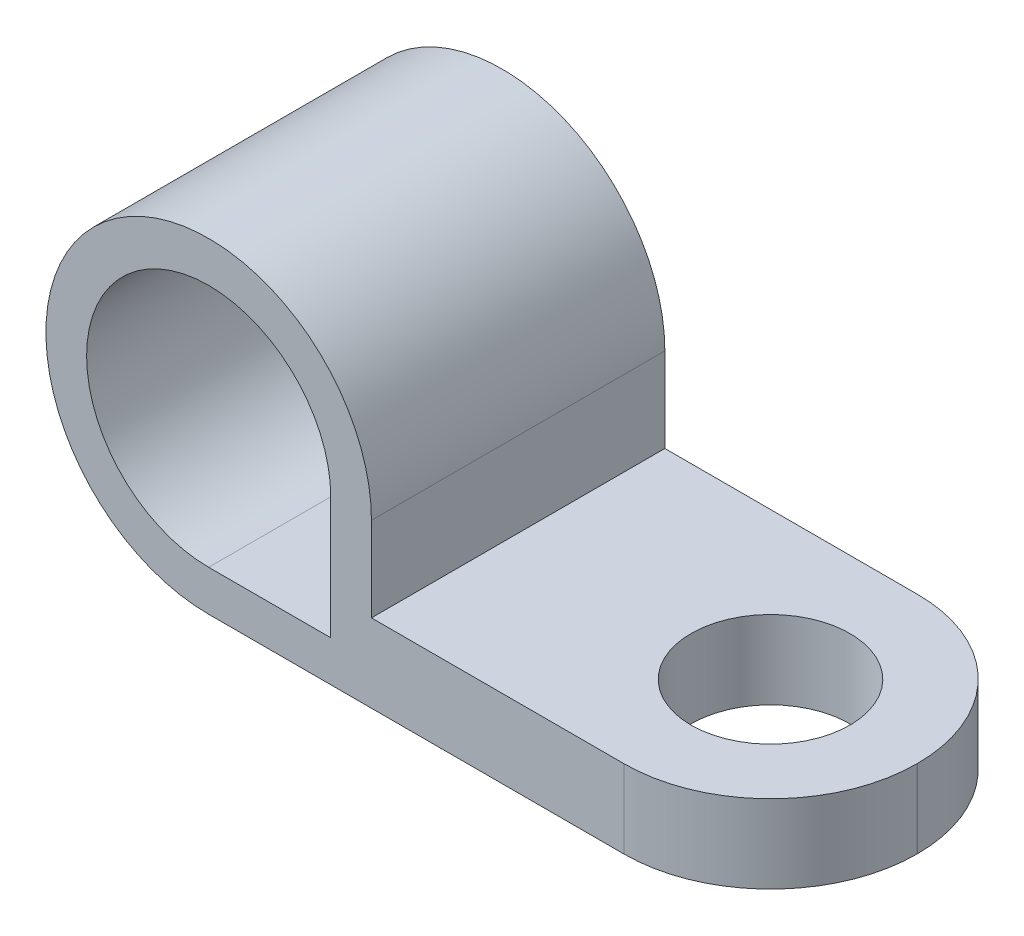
from build123d import *

# Parameters (mm, degrees)
EXTRUDE1_DEPTH     = 4.7625
FILLET1_R          = 4.7498
CUT_EXTRUDE1_START = -2.54
SKETCH3_R          = 2.5781
CUT_EXTRUDE1_DEPTH = 2.54


with BuildPart() as part:
    # Sketch1 → Extrude1 (new, symmetric)
    with BuildSketch(Plane.XY):
        with BuildLine():
            Line((0, -5.2832), (18.2372, -5.2832))
            Line((18.2372, -5.2832), (18.2372, -2.7432))
            Line((18.2372, -2.7432), (5.2832, -2.7432))
            Line((5.2832, -2.7432), (5.2832, 0))
            ThreePointArc((5.2832, 0), (-3.735786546, 3.735786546), (0, -5.2832))
        make_face()
        with BuildLine():
            Line((3.9624, 0), (3.9624, -3.9624))
            Line((3.9624, -3.9624), (0, -3.9624))
            ThreePointArc((0, -3.9624), (-2.80183991, 2.80183991), (3.9624, 0))
        make_face(mode=Mode.SUBTRACT)
    extrude(amount=EXTRUDE1_DEPTH, both=True)

    # Fillet1
    fillet1_edges = [part.edges().sort_by_distance(p)[0] for p in [
        (18.2372, -4.0132, 4.7625),
        (18.2372, -4.0132, -4.7625),
    ]]
    fillet(fillet1_edges, radius=FILLET1_R)

    # Sketch3 → Cut-Extrude1 (cut)
    with BuildSketch(Plane(origin=(0, -2.7432, 0), x_dir=(-1, 0, 0), z_dir=(0, 1, 0)).offset(CUT_EXTRUDE1_START)):
        with Locations(Location((-13.4874, 0.0127, 0), (0, 0, 90))):
            Circle(SKETCH3_R)
    extrude(amount=CUT_EXTRUDE1_DEPTH, mode=Mode.SUBTRACT)


solid = part.part
